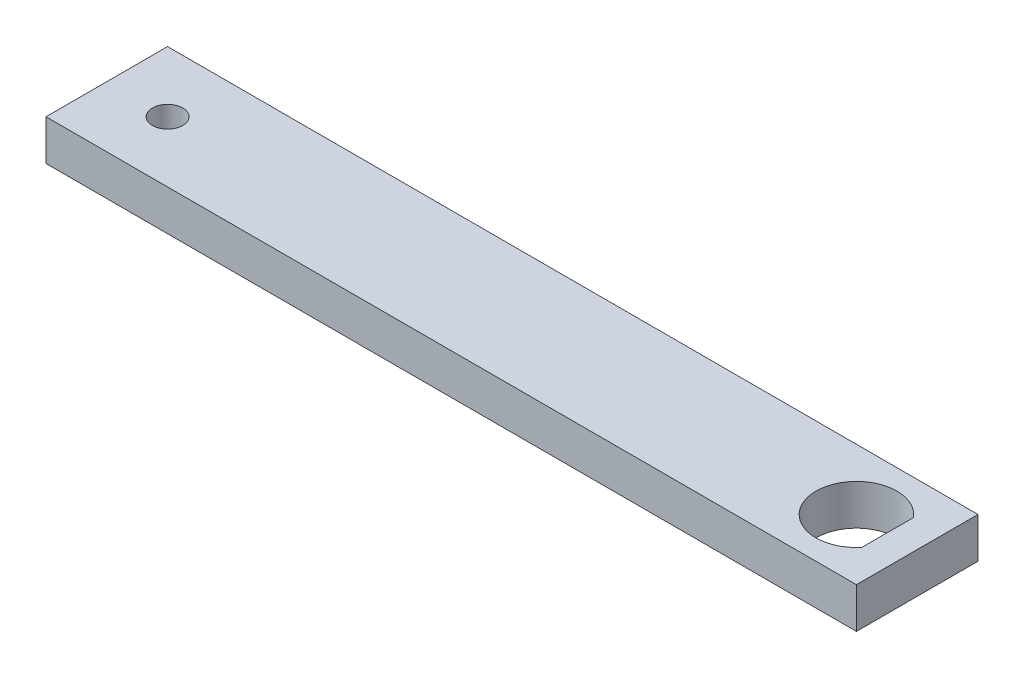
from build123d import *

# Parameters (mm, degrees)
SKETCH1_W          = 127
SKETCH1_H          = 6.35
BASE_EXTRUDE_DEPTH = 19.05
CUT_EXTRUDE1_DEPTH = 129.577700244
SKETCH3_R          = 2.38125
CUT_EXTRUDE2_DEPTH = 129.577700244


with BuildPart() as part:
    # Sketch1 → Base-Extrude (new body)
    with BuildSketch(Plane.XY):
        with Locations((63.5, 3.175)):
            Rectangle(SKETCH1_W, SKETCH1_H)
    extrude(amount=BASE_EXTRUDE_DEPTH)

    # Sketch2 → Cut-Extrude1 (cut, through all)
    with BuildSketch(Plane(origin=(0, 6.35, 0), x_dir=(-1, 0, 0), z_dir=(0, 1, 0))):
        with BuildLine():
            Line((-122.3645, 5.473421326), (-122.3645, 13.576578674))
            ThreePointArc((-122.3645, 13.576578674), (-111.125, 9.525), (-122.3645, 5.473421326))
        make_face()
    extrude(amount=-CUT_EXTRUDE1_DEPTH, mode=Mode.SUBTRACT)

    # Sketch3 → Cut-Extrude2 (cut, through all)
    with BuildSketch(Plane(origin=(0, 6.35, 0), x_dir=(-1, 0, 0), z_dir=(0, 1, 0))):
        with Locations((-9.525, 9.525)):
            Circle(SKETCH3_R)
    extrude(amount=-CUT_EXTRUDE2_DEPTH, mode=Mode.SUBTRACT)


solid = part.part
